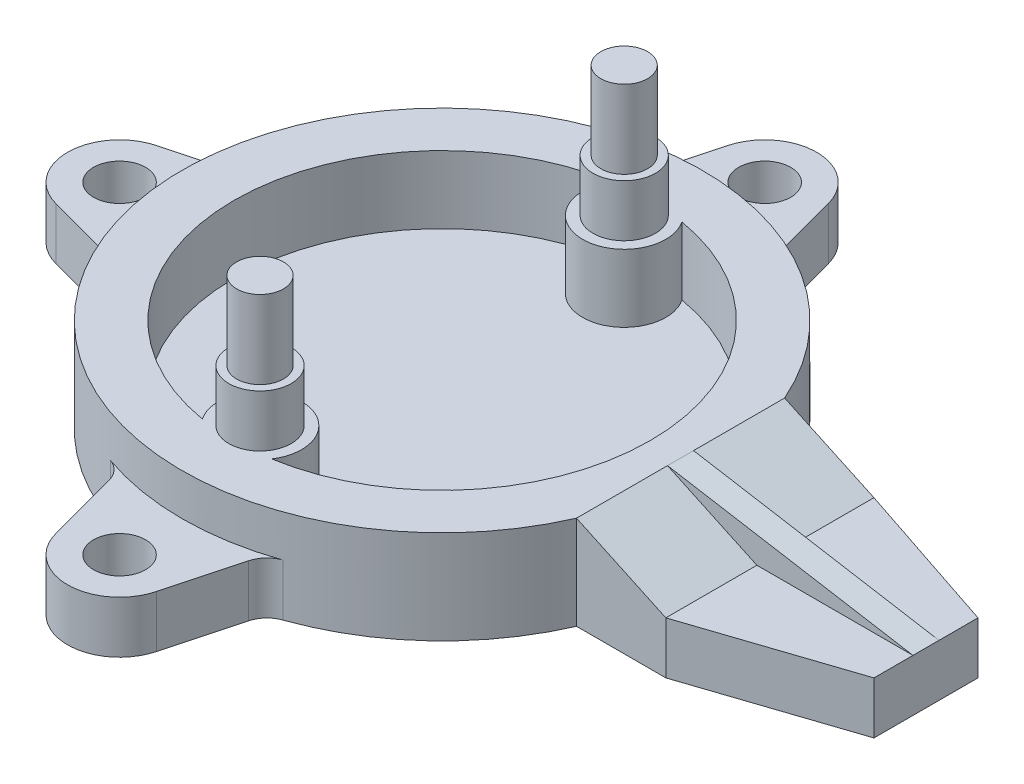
from build123d import *

# Parameters (mm, degrees)
SKETCH1_R               = 50
BOSS_EXTRUDE1_DEPTH     = 18
SKETCH2_R               = 40
CUT_EXTRUDE1_DEPTH      = 13
BOSS_EXTRUDE10_START    = -18
BOSS_EXTRUDE10_DEPTH    = 18
CUT_EXTRUDE2_DEPTH      = 108.112090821
CUT_EXTRUDE2_DEPTH_BACK = 108.112090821
RIB1_REACH              = 109.112
SKETCH5_WALL_W          = 264.071952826
SKETCH5_WALL_H          = 5
BOSS_EXTRUDE11_REACH    = 109.112
SKETCH6_R               = 8
SKETCH7_R               = 6
BOSS_EXTRUDE12_DEPTH    = 10
SKETCH8_R               = 4.5
BOSS_EXTRUDE13_DEPTH    = 15
SKETCH9_R               = 5
BOSS_EXTRUDE14_DEPTH    = 10
CIRPATTERN1_COUNT       = 4
FILLET1_R               = 5


with BuildPart() as part:
    # Sketch1 → Boss-Extrude1 (new body)
    with BuildSketch(Plane(origin=(0, 0, 0), x_dir=(1, 0, 0), z_dir=(0, 1, 0))):
        with Locations(Location((0, 0, 0), (0, 0, 270))):
            Circle(SKETCH1_R)
    extrude(amount=BOSS_EXTRUDE1_DEPTH)

    # Sketch2 → Cut-Extrude1 (cut)
    with BuildSketch(Plane(origin=(0, 18, 0), x_dir=(1, 0, 0), z_dir=(0, 1, 0))):
        with Locations(Location((0, 0, 0), (0, 0, 270))):
            Circle(SKETCH2_R)
    extrude(amount=-CUT_EXTRUDE1_DEPTH, mode=Mode.SUBTRACT)

    # Sketch3 → Boss-Extrude10 (add)
    with BuildSketch(Plane(origin=(0, 18, 0), x_dir=(1, 0, 0), z_dir=(0, 1, 0)).offset(BOSS_EXTRUDE10_START)):
        with BuildLine():
            Line((45.82575695, 20), (63, 20))
            Line((63, 20), (93, 10))
            Line((93, 10), (93, -10))
            Line((93, -10), (63, -20))
            Line((63, -20), (45.82575695, -20))
            ThreePointArc((45.82575695, -20), (50, 0), (45.82575695, 20))
        make_face()
    extrude(amount=BOSS_EXTRUDE10_DEPTH)

    # Sketch4 → Cut-Extrude2 (cut, two sides: drawn at the far end of the back side and taken through both)
    with BuildSketch(Plane.XY.offset(-CUT_EXTRUDE2_DEPTH_BACK)):
        Polygon((45.82575695, 18), (63, 10), (93, 10), (93, 18), align=None)
    extrude(amount=CUT_EXTRUDE2_DEPTH + CUT_EXTRUDE2_DEPTH_BACK, mode=Mode.SUBTRACT)

    # Sketch5 wall → Rib1 (add, up to next)
    with BuildSketch(Plane(origin=(69.412878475, 14, 0), x_dir=(-0.985923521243, 0.167196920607, 0), z_dir=(-0.167196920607, -0.985923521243, 0)), mode=Mode.PRIVATE) as rib1_sk1:
        Rectangle(SKETCH5_WALL_W, SKETCH5_WALL_H)
    rib1_tool1 = extrude(rib1_sk1.sketch, amount=RIB1_REACH, mode=Mode.PRIVATE) - part.part
    add(rib1_tool1.solids().sort_by_distance((69.412878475, 14, 0))[0])

    # Sketch6 → Boss-Extrude11 (add, up to next)
    with BuildSketch(Plane(origin=(0, 18, 0), x_dir=(1, 0, 0), z_dir=(0, 1, 0)), mode=Mode.PRIVATE) as boss_extrude11_sk1:
        with Locations((0, 35)):
            Circle(SKETCH6_R)
    boss_extrude11_tool1 = extrude(boss_extrude11_sk1.sketch, amount=-BOSS_EXTRUDE11_REACH, mode=Mode.PRIVATE) - part.part
    # Sketch6 → Boss-Extrude11 (add, up to next)
    with BuildSketch(Plane(origin=(0, 18, 0), x_dir=(1, 0, 0), z_dir=(0, 1, 0)), mode=Mode.PRIVATE) as boss_extrude11_sk2:
        with Locations((0, -35)):
            Circle(SKETCH6_R)
    boss_extrude11_tool2 = extrude(boss_extrude11_sk2.sketch, amount=-BOSS_EXTRUDE11_REACH, mode=Mode.PRIVATE) - part.part
    add(boss_extrude11_tool1.solids().sort_by_distance((0, 18, -35))[0])
    add(boss_extrude11_tool2.solids().sort_by_distance((0, 18, 35))[0])

    # Sketch7 → Boss-Extrude12 (add)
    with BuildSketch(Plane(origin=(0, 18, 0), x_dir=(1, 0, 0), z_dir=(0, 1, 0))):
        with Locations(Location((0, 35, 0), (0, 0, 270))):
            Circle(SKETCH7_R)
        with Locations(Location((0, -35, 0), (0, 0, 270))):
            Circle(SKETCH7_R)
    extrude(amount=BOSS_EXTRUDE12_DEPTH)

    # Sketch8 → Boss-Extrude13 (add)
    with BuildSketch(Plane(origin=(0, 28, 0), x_dir=(1, 0, 0), z_dir=(0, 1, 0))):
        with Locations(Location((0, 35, 0), (0, 0, 270))):
            Circle(SKETCH8_R)
        with Locations(Location((0, -35, 0), (0, 0, 270))):
            Circle(SKETCH8_R)
    extrude(amount=BOSS_EXTRUDE13_DEPTH)

    # Sketch9 → Boss-Extrude14 (add)
    with BuildSketch(Plane.XZ):
        with BuildLine():
            Line((-47.96692268, 14.112913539), (-64.588190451, 9.659258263))
            ThreePointArc((-64.588190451, 9.659258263), (-72, 0), (-64.588190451, -9.659258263))
            Line((-64.588190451, -9.659258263), (-47.96692268, -14.112913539))
            ThreePointArc((-47.96692268, -14.112913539), (-50, 0), (-47.96692268, 14.112913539))
        make_face()
        with Locations(Location((-62, 0, 0), (0, 0, 270))):
            Circle(SKETCH9_R, mode=Mode.SUBTRACT)
    boss_extrude14 = extrude(amount=-BOSS_EXTRUDE14_DEPTH)

    # CirPattern1: Boss-Extrude14 ×4 about axis, 1 skipped
    cirpattern1_axis = Axis((0, 0, 0), (0, -1, 0))
    add([boss_extrude14.rotate(cirpattern1_axis, i * 360 / CIRPATTERN1_COUNT) for i in range(1, CIRPATTERN1_COUNT) if i not in (2,)])

    # Fillet1
    fillet1_edges = [part.edges().sort_by_distance(p)[0] for p in [
        (-47.96692268, 5, 14.112913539),
        (-47.96692268, 5, -14.112913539),
        (-14.112913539, 5, -47.96692268),
        (14.112913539, 5, -47.96692268),
        (14.112913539, 5, 47.96692268),
        (-14.112913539, 5, 47.96692268),
    ]]
    fillet(fillet1_edges, radius=FILLET1_R)


solid = part.part
